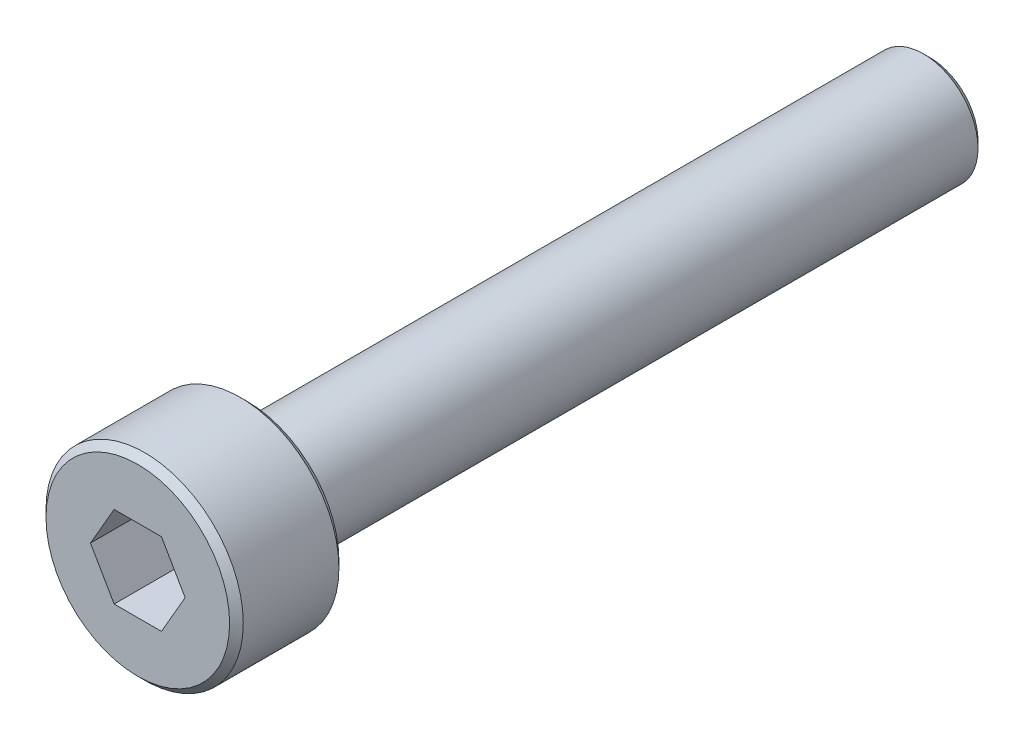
ISO-10303-21;
HEADER;
FILE_DESCRIPTION(('STEP AP214'),'2;1');
FILE_NAME('part.step','',(''),(''),'','','');
FILE_SCHEMA(('AUTOMOTIVE_DESIGN { 1 0 10303 214 1 1 1 1 }'));
ENDSEC;
DATA;
#1=APPLICATION_CONTEXT('core data for automotive mechanical design processes');
#2=APPLICATION_PROTOCOL_DEFINITION('international standard','automotive_design',2000,#1);
#3=PRODUCT_CONTEXT('',#1,'mechanical');
#4=PRODUCT('Part','Part','',(#3));
#5=PRODUCT_RELATED_PRODUCT_CATEGORY('part','',(#4));
#6=PRODUCT_DEFINITION_FORMATION('','',#4);
#7=PRODUCT_DEFINITION_CONTEXT('part definition',#1,'design');
#8=PRODUCT_DEFINITION('design','',#6,#7);
#9=PRODUCT_DEFINITION_SHAPE('','',#8);
#10=(LENGTH_UNIT() NAMED_UNIT(*) SI_UNIT(.MILLI.,.METRE.));
#11=(NAMED_UNIT(*) PLANE_ANGLE_UNIT() SI_UNIT($,.RADIAN.));
#12=(NAMED_UNIT(*) SI_UNIT($,.STERADIAN.) SOLID_ANGLE_UNIT());
#13=UNCERTAINTY_MEASURE_WITH_UNIT(LENGTH_MEASURE(1.E-05),#10,'distance_accuracy_value','');
#14=(GEOMETRIC_REPRESENTATION_CONTEXT(3) GLOBAL_UNCERTAINTY_ASSIGNED_CONTEXT((#13)) GLOBAL_UNIT_ASSIGNED_CONTEXT((#10,
#11,#12)) REPRESENTATION_CONTEXT('',''));
#15=CARTESIAN_POINT('',(0.,0.,0.));
#16=DIRECTION('',(0.,0.,1.));
#17=DIRECTION('',(1.,0.,0.));
#18=AXIS2_PLACEMENT_3D('',#15,#16,#17);
#19=CARTESIAN_POINT('',(0.,0.,25.));
#20=DIRECTION('',(0.,0.,-1.));
#21=DIRECTION('',(-1.,0.,0.));
#22=AXIS2_PLACEMENT_3D('',#19,#20,#21);
#23=CYLINDRICAL_SURFACE('',#22,2.);
#24=CARTESIAN_POINT('',(0.,0.,0.25));
#25=DIRECTION('',(0.,0.,1.));
#26=DIRECTION('',(1.,0.,0.));
#27=AXIS2_PLACEMENT_3D('',#24,#25,#26);
#28=CIRCLE('',#27,2.);
#29=CARTESIAN_POINT('',(2.,0.,0.25));
#30=VERTEX_POINT('',#29);
#31=EDGE_CURVE('E176',#30,#30,#28,.T.);
#32=ORIENTED_EDGE('',*,*,#31,.T.);
#33=EDGE_LOOP('',(#32));
#34=FACE_BOUND('',#33,.T.);
#35=CARTESIAN_POINT('',(0.,0.,25.));
#36=DIRECTION('',(0.,0.,1.));
#37=DIRECTION('',(1.,0.,0.));
#38=AXIS2_PLACEMENT_3D('',#35,#36,#37);
#39=CIRCLE('',#38,2.);
#40=CARTESIAN_POINT('',(2.,0.,25.));
#41=VERTEX_POINT('',#40);
#42=EDGE_CURVE('E162',#41,#41,#39,.T.);
#43=ORIENTED_EDGE('',*,*,#42,.F.);
#44=EDGE_LOOP('',(#43));
#45=FACE_BOUND('',#44,.T.);
#46=ADVANCED_FACE('F50',(#34,#45),#23,.T.);
#47=CARTESIAN_POINT('',(0.,0.,0.));
#48=DIRECTION('',(0.,0.,1.));
#49=DIRECTION('',(1.,0.,0.));
#50=AXIS2_PLACEMENT_3D('',#47,#48,#49);
#51=PLANE('',#50);
#52=CARTESIAN_POINT('',(0.,0.,0.));
#53=DIRECTION('',(0.,0.,1.));
#54=DIRECTION('',(1.,0.,0.));
#55=AXIS2_PLACEMENT_3D('',#52,#53,#54);
#56=CIRCLE('',#55,1.75);
#57=CARTESIAN_POINT('',(1.75,0.,0.));
#58=VERTEX_POINT('',#57);
#59=EDGE_CURVE('E179',#58,#58,#56,.F.);
#60=ORIENTED_EDGE('',*,*,#59,.T.);
#61=EDGE_LOOP('',(#60));
#62=FACE_BOUND('',#61,.T.);
#63=ADVANCED_FACE('F208',(#62),#51,.F.);
#64=CARTESIAN_POINT('',(0.,0.,29.));
#65=DIRECTION('',(0.,0.,-1.));
#66=DIRECTION('',(-1.,0.,0.));
#67=AXIS2_PLACEMENT_3D('',#64,#65,#66);
#68=CYLINDRICAL_SURFACE('',#67,3.61);
#69=CARTESIAN_POINT('',(0.,0.,25.25));
#70=DIRECTION('',(0.,0.,1.));
#71=DIRECTION('',(1.,0.,0.));
#72=AXIS2_PLACEMENT_3D('',#69,#70,#71);
#73=CIRCLE('',#72,3.61);
#74=CARTESIAN_POINT('',(3.61,0.,25.25));
#75=VERTEX_POINT('',#74);
#76=EDGE_CURVE('E190',#75,#75,#73,.T.);
#77=ORIENTED_EDGE('',*,*,#76,.T.);
#78=EDGE_LOOP('',(#77));
#79=FACE_BOUND('',#78,.T.);
#80=CARTESIAN_POINT('',(0.,0.,28.75));
#81=DIRECTION('',(0.,0.,1.));
#82=DIRECTION('',(1.,0.,0.));
#83=AXIS2_PLACEMENT_3D('',#80,#81,#82);
#84=CIRCLE('',#83,3.61);
#85=CARTESIAN_POINT('',(3.61,0.,28.75));
#86=VERTEX_POINT('',#85);
#87=EDGE_CURVE('E184',#86,#86,#84,.F.);
#88=ORIENTED_EDGE('',*,*,#87,.T.);
#89=EDGE_LOOP('',(#88));
#90=FACE_BOUND('',#89,.T.);
#91=ADVANCED_FACE('F204',(#79,#90),#68,.T.);
#92=CARTESIAN_POINT('',(0.,0.,29.));
#93=DIRECTION('',(0.,0.,1.));
#94=DIRECTION('',(1.,0.,0.));
#95=AXIS2_PLACEMENT_3D('',#92,#93,#94);
#96=PLANE('',#95);
#97=CARTESIAN_POINT('',(0.,0.,29.));
#98=DIRECTION('',(0.,0.,1.));
#99=DIRECTION('',(1.,0.,0.));
#100=AXIS2_PLACEMENT_3D('',#97,#98,#99);
#101=CIRCLE('',#100,3.36);
#102=CARTESIAN_POINT('',(3.36,0.,29.));
#103=VERTEX_POINT('',#102);
#104=EDGE_CURVE('E11',#103,#103,#101,.T.);
#105=ORIENTED_EDGE('',*,*,#104,.T.);
#106=EDGE_LOOP('',(#105));
#107=FACE_BOUND('',#106,.T.);
#108=DIRECTION('',(0.5,0.866025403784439,0.));
#109=VECTOR('',#108,1.);
#110=CARTESIAN_POINT('',(0.866025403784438,-1.5,29.));
#111=LINE('',#110,#109);
#112=CARTESIAN_POINT('',(0.866025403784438,-1.5,29.));
#113=VERTEX_POINT('',#112);
#114=CARTESIAN_POINT('',(1.73205080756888,0.,29.));
#115=VERTEX_POINT('',#114);
#116=EDGE_CURVE('E61',#113,#115,#111,.T.);
#117=ORIENTED_EDGE('',*,*,#116,.F.);
#118=DIRECTION('',(1.,0.,0.));
#119=VECTOR('',#118,1.);
#120=CARTESIAN_POINT('',(-0.866025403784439,-1.5,29.));
#121=LINE('',#120,#119);
#122=CARTESIAN_POINT('',(-0.866025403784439,-1.5,29.));
#123=VERTEX_POINT('',#122);
#124=EDGE_CURVE('E160',#123,#113,#121,.T.);
#125=ORIENTED_EDGE('',*,*,#124,.F.);
#126=DIRECTION('',(0.5,-0.866025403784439,0.));
#127=VECTOR('',#126,1.);
#128=CARTESIAN_POINT('',(-1.73205080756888,0.,29.));
#129=LINE('',#128,#127);
#130=CARTESIAN_POINT('',(-1.73205080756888,0.,29.));
#131=VERTEX_POINT('',#130);
#132=EDGE_CURVE('E152',#131,#123,#129,.T.);
#133=ORIENTED_EDGE('',*,*,#132,.F.);
#134=DIRECTION('',(-0.5,-0.866025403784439,0.));
#135=VECTOR('',#134,1.);
#136=CARTESIAN_POINT('',(-0.866025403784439,1.5,29.));
#137=LINE('',#136,#135);
#138=CARTESIAN_POINT('',(-0.866025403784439,1.5,29.));
#139=VERTEX_POINT('',#138);
#140=EDGE_CURVE('E115',#139,#131,#137,.T.);
#141=ORIENTED_EDGE('',*,*,#140,.F.);
#142=DIRECTION('',(-1.,0.,0.));
#143=VECTOR('',#142,1.);
#144=CARTESIAN_POINT('',(0.866025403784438,1.5,29.));
#145=LINE('',#144,#143);
#146=CARTESIAN_POINT('',(0.866025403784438,1.5,29.));
#147=VERTEX_POINT('',#146);
#148=EDGE_CURVE('E146',#147,#139,#145,.T.);
#149=ORIENTED_EDGE('',*,*,#148,.F.);
#150=DIRECTION('',(-0.5,0.866025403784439,0.));
#151=VECTOR('',#150,1.);
#152=CARTESIAN_POINT('',(1.73205080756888,0.,29.));
#153=LINE('',#152,#151);
#154=EDGE_CURVE('E145',#115,#147,#153,.T.);
#155=ORIENTED_EDGE('',*,*,#154,.F.);
#156=EDGE_LOOP('',(#117,#125,#133,#141,#149,#155));
#157=FACE_BOUND('',#156,.T.);
#158=ADVANCED_FACE('F210',(#107,#157),#96,.T.);
#159=CARTESIAN_POINT('',(0.,0.,25.));
#160=DIRECTION('',(0.,0.,1.));
#161=DIRECTION('',(1.,0.,0.));
#162=AXIS2_PLACEMENT_3D('',#159,#160,#161);
#163=PLANE('',#162);
#164=CARTESIAN_POINT('',(0.,0.,25.));
#165=DIRECTION('',(0.,0.,1.));
#166=DIRECTION('',(1.,0.,0.));
#167=AXIS2_PLACEMENT_3D('',#164,#165,#166);
#168=CIRCLE('',#167,3.36);
#169=CARTESIAN_POINT('',(3.36,0.,25.));
#170=VERTEX_POINT('',#169);
#171=EDGE_CURVE('E60',#170,#170,#168,.F.);
#172=ORIENTED_EDGE('',*,*,#171,.T.);
#173=EDGE_LOOP('',(#172));
#174=FACE_BOUND('',#173,.T.);
#175=ORIENTED_EDGE('',*,*,#42,.T.);
#176=EDGE_LOOP('',(#175));
#177=FACE_BOUND('',#176,.T.);
#178=ADVANCED_FACE('F194',(#174,#177),#163,.F.);
#179=CARTESIAN_POINT('',(0.866025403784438,-1.5,26.5));
#180=DIRECTION('',(0.866025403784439,-0.5,0.));
#181=DIRECTION('',(0.5,0.866025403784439,0.));
#182=AXIS2_PLACEMENT_3D('',#179,#180,#181);
#183=PLANE('',#182);
#184=ORIENTED_EDGE('',*,*,#116,.T.);
#185=DIRECTION('',(0.,0.,1.));
#186=VECTOR('',#185,1.);
#187=CARTESIAN_POINT('',(1.73205080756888,0.,26.5));
#188=LINE('',#187,#186);
#189=CARTESIAN_POINT('',(1.73205080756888,0.,26.5));
#190=VERTEX_POINT('',#189);
#191=EDGE_CURVE('E94',#190,#115,#188,.T.);
#192=ORIENTED_EDGE('',*,*,#191,.F.);
#193=DIRECTION('',(0.5,0.866025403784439,0.));
#194=VECTOR('',#193,1.);
#195=CARTESIAN_POINT('',(0.866025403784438,-1.5,26.5));
#196=LINE('',#195,#194);
#197=CARTESIAN_POINT('',(0.866025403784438,-1.5,26.5));
#198=VERTEX_POINT('',#197);
#199=EDGE_CURVE('E159',#198,#190,#196,.T.);
#200=ORIENTED_EDGE('',*,*,#199,.F.);
#201=DIRECTION('',(0.,0.,1.));
#202=VECTOR('',#201,1.);
#203=CARTESIAN_POINT('',(0.866025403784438,-1.5,26.5));
#204=LINE('',#203,#202);
#205=EDGE_CURVE('E75',#198,#113,#204,.T.);
#206=ORIENTED_EDGE('',*,*,#205,.T.);
#207=EDGE_LOOP('',(#184,#192,#200,#206));
#208=FACE_BOUND('',#207,.T.);
#209=ADVANCED_FACE('F229',(#208),#183,.F.);
#210=CARTESIAN_POINT('',(-0.866025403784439,-1.5,26.5));
#211=DIRECTION('',(0.,-1.,0.));
#212=DIRECTION('',(1.,0.,0.));
#213=AXIS2_PLACEMENT_3D('',#210,#211,#212);
#214=PLANE('',#213);
#215=ORIENTED_EDGE('',*,*,#124,.T.);
#216=ORIENTED_EDGE('',*,*,#205,.F.);
#217=DIRECTION('',(1.,0.,0.));
#218=VECTOR('',#217,1.);
#219=CARTESIAN_POINT('',(-0.866025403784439,-1.5,26.5));
#220=LINE('',#219,#218);
#221=CARTESIAN_POINT('',(-0.866025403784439,-1.5,26.5));
#222=VERTEX_POINT('',#221);
#223=EDGE_CURVE('E127',#222,#198,#220,.T.);
#224=ORIENTED_EDGE('',*,*,#223,.F.);
#225=DIRECTION('',(0.,0.,1.));
#226=VECTOR('',#225,1.);
#227=CARTESIAN_POINT('',(-0.866025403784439,-1.5,26.5));
#228=LINE('',#227,#226);
#229=EDGE_CURVE('E119',#222,#123,#228,.T.);
#230=ORIENTED_EDGE('',*,*,#229,.T.);
#231=EDGE_LOOP('',(#215,#216,#224,#230));
#232=FACE_BOUND('',#231,.T.);
#233=ADVANCED_FACE('F226',(#232),#214,.F.);
#234=CARTESIAN_POINT('',(-1.73205080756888,0.,26.5));
#235=DIRECTION('',(-0.866025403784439,-0.5,0.));
#236=DIRECTION('',(0.5,-0.866025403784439,0.));
#237=AXIS2_PLACEMENT_3D('',#234,#235,#236);
#238=PLANE('',#237);
#239=ORIENTED_EDGE('',*,*,#132,.T.);
#240=ORIENTED_EDGE('',*,*,#229,.F.);
#241=DIRECTION('',(0.5,-0.866025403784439,0.));
#242=VECTOR('',#241,1.);
#243=CARTESIAN_POINT('',(-1.73205080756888,0.,26.5));
#244=LINE('',#243,#242);
#245=CARTESIAN_POINT('',(-1.73205080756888,0.,26.5));
#246=VERTEX_POINT('',#245);
#247=EDGE_CURVE('E121',#246,#222,#244,.T.);
#248=ORIENTED_EDGE('',*,*,#247,.F.);
#249=DIRECTION('',(0.,0.,1.));
#250=VECTOR('',#249,1.);
#251=CARTESIAN_POINT('',(-1.73205080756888,0.,26.5));
#252=LINE('',#251,#250);
#253=EDGE_CURVE('E104',#246,#131,#252,.T.);
#254=ORIENTED_EDGE('',*,*,#253,.T.);
#255=EDGE_LOOP('',(#239,#240,#248,#254));
#256=FACE_BOUND('',#255,.T.);
#257=ADVANCED_FACE('F125',(#256),#238,.F.);
#258=CARTESIAN_POINT('',(-0.866025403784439,1.5,26.5));
#259=DIRECTION('',(-0.866025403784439,0.5,0.));
#260=DIRECTION('',(-0.5,-0.866025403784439,0.));
#261=AXIS2_PLACEMENT_3D('',#258,#259,#260);
#262=PLANE('',#261);
#263=ORIENTED_EDGE('',*,*,#140,.T.);
#264=ORIENTED_EDGE('',*,*,#253,.F.);
#265=DIRECTION('',(-0.5,-0.866025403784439,0.));
#266=VECTOR('',#265,1.);
#267=CARTESIAN_POINT('',(-0.866025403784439,1.5,26.5));
#268=LINE('',#267,#266);
#269=CARTESIAN_POINT('',(-0.866025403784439,1.5,26.5));
#270=VERTEX_POINT('',#269);
#271=EDGE_CURVE('E108',#270,#246,#268,.T.);
#272=ORIENTED_EDGE('',*,*,#271,.F.);
#273=DIRECTION('',(0.,0.,1.));
#274=VECTOR('',#273,1.);
#275=CARTESIAN_POINT('',(-0.866025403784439,1.5,26.5));
#276=LINE('',#275,#274);
#277=EDGE_CURVE('E120',#270,#139,#276,.T.);
#278=ORIENTED_EDGE('',*,*,#277,.T.);
#279=EDGE_LOOP('',(#263,#264,#272,#278));
#280=FACE_BOUND('',#279,.T.);
#281=ADVANCED_FACE('F110',(#280),#262,.F.);
#282=CARTESIAN_POINT('',(0.866025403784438,1.5,26.5));
#283=DIRECTION('',(0.,1.,0.));
#284=DIRECTION('',(-1.,0.,0.));
#285=AXIS2_PLACEMENT_3D('',#282,#283,#284);
#286=PLANE('',#285);
#287=ORIENTED_EDGE('',*,*,#148,.T.);
#288=ORIENTED_EDGE('',*,*,#277,.F.);
#289=DIRECTION('',(-1.,0.,0.));
#290=VECTOR('',#289,1.);
#291=CARTESIAN_POINT('',(0.866025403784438,1.5,26.5));
#292=LINE('',#291,#290);
#293=CARTESIAN_POINT('',(0.866025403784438,1.5,26.5));
#294=VERTEX_POINT('',#293);
#295=EDGE_CURVE('E134',#294,#270,#292,.T.);
#296=ORIENTED_EDGE('',*,*,#295,.F.);
#297=DIRECTION('',(0.,0.,1.));
#298=VECTOR('',#297,1.);
#299=CARTESIAN_POINT('',(0.866025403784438,1.5,26.5));
#300=LINE('',#299,#298);
#301=EDGE_CURVE('E169',#294,#147,#300,.T.);
#302=ORIENTED_EDGE('',*,*,#301,.T.);
#303=EDGE_LOOP('',(#287,#288,#296,#302));
#304=FACE_BOUND('',#303,.T.);
#305=ADVANCED_FACE('F268',(#304),#286,.F.);
#306=CARTESIAN_POINT('',(1.73205080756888,0.,26.5));
#307=DIRECTION('',(0.866025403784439,0.5,0.));
#308=DIRECTION('',(-0.5,0.866025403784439,0.));
#309=AXIS2_PLACEMENT_3D('',#306,#307,#308);
#310=PLANE('',#309);
#311=ORIENTED_EDGE('',*,*,#154,.T.);
#312=ORIENTED_EDGE('',*,*,#301,.F.);
#313=DIRECTION('',(-0.5,0.866025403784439,0.));
#314=VECTOR('',#313,1.);
#315=CARTESIAN_POINT('',(1.73205080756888,0.,26.5));
#316=LINE('',#315,#314);
#317=EDGE_CURVE('E136',#190,#294,#316,.T.);
#318=ORIENTED_EDGE('',*,*,#317,.F.);
#319=ORIENTED_EDGE('',*,*,#191,.T.);
#320=EDGE_LOOP('',(#311,#312,#318,#319));
#321=FACE_BOUND('',#320,.T.);
#322=ADVANCED_FACE('F224',(#321),#310,.F.);
#323=CARTESIAN_POINT('',(0.,0.,26.5));
#324=DIRECTION('',(0.,0.,1.));
#325=DIRECTION('',(1.,0.,0.));
#326=AXIS2_PLACEMENT_3D('',#323,#324,#325);
#327=PLANE('',#326);
#328=ORIENTED_EDGE('',*,*,#199,.T.);
#329=ORIENTED_EDGE('',*,*,#317,.T.);
#330=ORIENTED_EDGE('',*,*,#295,.T.);
#331=ORIENTED_EDGE('',*,*,#271,.T.);
#332=ORIENTED_EDGE('',*,*,#247,.T.);
#333=ORIENTED_EDGE('',*,*,#223,.T.);
#334=EDGE_LOOP('',(#328,#329,#330,#331,#332,#333));
#335=FACE_BOUND('',#334,.T.);
#336=ADVANCED_FACE('F129',(#335),#327,.T.);
#337=CARTESIAN_POINT('',(0.,0.,0.25));
#338=DIRECTION('',(0.,0.,1.));
#339=DIRECTION('',(1.,0.,0.));
#340=AXIS2_PLACEMENT_3D('',#337,#338,#339);
#341=CONICAL_SURFACE('',#340,2.,0.785398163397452);
#342=ORIENTED_EDGE('',*,*,#59,.F.);
#343=EDGE_LOOP('',(#342));
#344=FACE_BOUND('',#343,.T.);
#345=ORIENTED_EDGE('',*,*,#31,.F.);
#346=EDGE_LOOP('',(#345));
#347=FACE_BOUND('',#346,.T.);
#348=ADVANCED_FACE('F203',(#344,#347),#341,.T.);
#349=CARTESIAN_POINT('',(0.,0.,25.25));
#350=DIRECTION('',(0.,0.,1.));
#351=DIRECTION('',(1.,0.,0.));
#352=AXIS2_PLACEMENT_3D('',#349,#350,#351);
#353=CONICAL_SURFACE('',#352,3.61,0.785398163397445);
#354=ORIENTED_EDGE('',*,*,#171,.F.);
#355=EDGE_LOOP('',(#354));
#356=FACE_BOUND('',#355,.T.);
#357=ORIENTED_EDGE('',*,*,#76,.F.);
#358=EDGE_LOOP('',(#357));
#359=FACE_BOUND('',#358,.T.);
#360=ADVANCED_FACE('F196',(#356,#359),#353,.T.);
#361=CARTESIAN_POINT('',(0.,0.,29.));
#362=DIRECTION('',(0.,0.,-1.));
#363=DIRECTION('',(-1.,0.,0.));
#364=AXIS2_PLACEMENT_3D('',#361,#362,#363);
#365=CONICAL_SURFACE('',#364,3.36,0.785398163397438);
#366=ORIENTED_EDGE('',*,*,#87,.F.);
#367=EDGE_LOOP('',(#366));
#368=FACE_BOUND('',#367,.T.);
#369=ORIENTED_EDGE('',*,*,#104,.F.);
#370=EDGE_LOOP('',(#369));
#371=FACE_BOUND('',#370,.T.);
#372=ADVANCED_FACE('F49',(#368,#371),#365,.T.);
#373=CLOSED_SHELL('',(#46,#63,#91,#158,#178,#209,#233,#257,#281,#305,#322,#336,#348,#360,#372));
#374=MANIFOLD_SOLID_BREP('B2',#373);
#375=ADVANCED_BREP_SHAPE_REPRESENTATION('',(#18,#374),#14);
#376=SHAPE_DEFINITION_REPRESENTATION(#9,#375);
ENDSEC;
END-ISO-10303-21;
